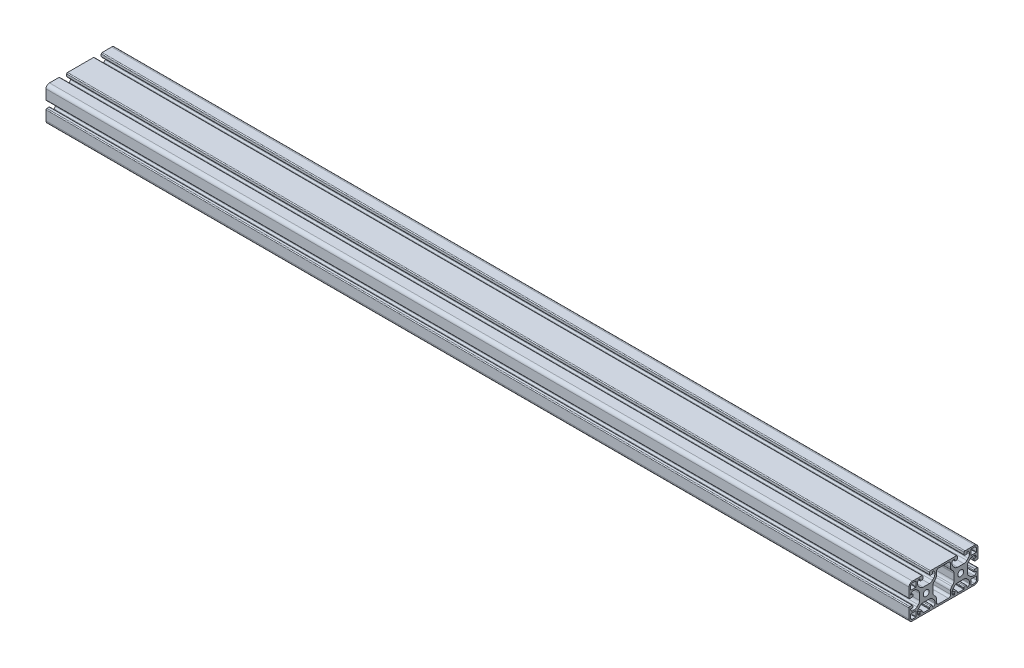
from build123d import *

# Parameters (mm, degrees)
MODEL_R                = 3.4
STRUKTURBAUTEIL1_DEPTH = 1000


with BuildPart() as part:
    # Model → Strukturbauteil1 (new body)
    with BuildSketch(Plane(origin=(0, 0, 0), x_dir=(0, 0, -1), z_dir=(1, 0, 0))):
        with BuildLine():
            Line((12.9068525, 9.2144665), (11.4644655, 10.6568555))
            ThreePointArc((11.4644655, 10.6568555), (10.380602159, 12.278971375), (9.9999995, 14.1923875))
            Line((9.9999995, 14.1923875), (9.9999995, 15.5000005))
            ThreePointArc((9.9999995, 15.5000005), (10.732232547, 17.267767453), (12.4999995, 18.0000005))
            Line((12.4999995, 18.0000005), (12.5499985, 18.0000005))
            ThreePointArc((12.5499985, 18.0000005), (12.868197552, 17.868198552), (12.9999995, 17.5499995))
            Line((12.9999995, 17.5499995), (12.9999995, 16.0000005))
            ThreePointArc((12.9999995, 16.0000005), (13.146446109, 15.646447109), (13.4999995, 15.5000005))
            Line((13.4999995, 15.5000005), (14.9999995, 15.5000005))
            ThreePointArc((14.9999995, 15.5000005), (15.707106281, 15.792893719), (15.9999995, 16.5000005))
            Line((15.9999995, 16.5000005), (15.9999995, 19.0000005))
            ThreePointArc((15.9999995, 19.0000005), (15.707106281, 19.707107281), (14.9999995, 20.0000005))
            Line((14.9999995, 20.0000005), (-15.0000005, 20.0000005))
            ThreePointArc((-15.0000005, 20.0000005), (-15.707107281, 19.707107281), (-16.0000005, 19.0000005))
            Line((-16.0000005, 19.0000005), (-16.0000005, 16.5000005))
            ThreePointArc((-16.0000005, 16.5000005), (-15.707107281, 15.792893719), (-15.0000005, 15.5000005))
            Line((-15.0000005, 15.5000005), (-13.5000005, 15.5000005))
            ThreePointArc((-13.5000005, 15.5000005), (-13.146447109, 15.646447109), (-13.0000005, 16.0000005))
            Line((-13.0000005, 16.0000005), (-13.0000005, 17.5499995))
            ThreePointArc((-13.0000005, 17.5499995), (-12.868198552, 17.868198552), (-12.5499995, 18.0000005))
            Line((-12.5499995, 18.0000005), (-12.5000005, 18.0000005))
            ThreePointArc((-12.5000005, 18.0000005), (-10.732233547, 17.267767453), (-10.0000005, 15.5000005))
            Line((-10.0000005, 15.5000005), (-10.0000005, 14.1923875))
            ThreePointArc((-10.0000005, 14.1923875), (-10.380603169, 12.278971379), (-11.4644665, 10.6568555))
            Line((-11.4644665, 10.6568555), (-12.9068555, 9.2144665))
            ThreePointArc((-12.9068555, 9.2144665), (-14.528972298, 8.130602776), (-16.4423895, 7.7500005))
            Line((-16.4423895, 7.7500005), (-23.5576115, 7.7500005))
            ThreePointArc((-23.5576115, 7.7500005), (-25.471028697, 8.130602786), (-27.0931455, 9.2144665))
            Line((-27.0931455, 9.2144665), (-28.5355345, 10.6568555))
            ThreePointArc((-28.5355345, 10.6568555), (-29.619397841, 12.278971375), (-30.0000005, 14.1923875))
            Line((-30.0000005, 14.1923875), (-30.0000005, 15.5000005))
            ThreePointArc((-30.0000005, 15.5000005), (-29.267767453, 17.267767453), (-27.5000005, 18.0000005))
            Line((-27.5000005, 18.0000005), (-27.4500005, 18.0000005))
            ThreePointArc((-27.4500005, 18.0000005), (-27.131802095, 17.868198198), (-27.0000005, 17.5499995))
            Line((-27.0000005, 17.5499995), (-27.0000005, 16.0000005))
            ThreePointArc((-27.0000005, 16.0000005), (-26.853553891, 15.646447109), (-26.5000005, 15.5000005))
            Line((-26.5000005, 15.5000005), (-25.0000005, 15.5000005))
            ThreePointArc((-25.0000005, 15.5000005), (-24.292893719, 15.792893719), (-24.0000005, 16.5000005))
            Line((-24.0000005, 16.5000005), (-24.0000005, 19.0000005))
            ThreePointArc((-24.0000005, 19.0000005), (-24.292893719, 19.707107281), (-25.0000005, 20.0000005))
            Line((-25.0000005, 20.0000005), (-36.0000005, 20.0000005))
            ThreePointArc((-36.0000005, 20.0000005), (-38.828427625, 18.828427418), (-40, 16))
            Line((-40, 16), (-40, 5))
            ThreePointArc((-40, 5), (-39.707106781, 4.292893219), (-39, 4))
            Line((-39, 4), (-36.5, 4))
            ThreePointArc((-36.5, 4), (-35.792893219, 4.292893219), (-35.5, 5))
            Line((-35.5, 5), (-35.5, 6.5))
            ThreePointArc((-35.5, 6.5), (-35.646446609, 6.853553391), (-36, 7))
            Line((-36, 7), (-37.55, 7))
            ThreePointArc((-37.55, 7), (-37.868198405, 7.131802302), (-38, 7.450001))
            Line((-38, 7.450001), (-38, 7.5))
            ThreePointArc((-38, 7.5), (-37.267766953, 9.267766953), (-35.5, 10))
            Line((-35.5, 10), (-34.192388, 10))
            ThreePointArc((-34.192388, 10), (-32.278971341, 9.619397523), (-30.656855, 8.535534))
            Line((-30.656855, 8.535534), (-29.214466, 7.093145))
            ThreePointArc((-29.214466, 7.093145), (-28.130602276, 5.471028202), (-27.75, 3.557611))
            Line((-27.75, 3.557611), (-27.75, -3.557611))
            ThreePointArc((-27.75, -3.557611), (-28.130602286, -5.471028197), (-29.214466, -7.093145))
            Line((-29.214466, -7.093145), (-30.656855, -8.535534))
            ThreePointArc((-30.656855, -8.535534), (-32.278971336, -9.619397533), (-34.192388, -10))
            Line((-34.192388, -10), (-35.5, -10))
            ThreePointArc((-35.5, -10), (-37.267766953, -9.267766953), (-38, -7.5))
            Line((-38, -7.5), (-38, -7.45))
            ThreePointArc((-38, -7.45), (-37.868198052, -7.131801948), (-37.55, -7))
            Line((-37.55, -7), (-36, -7))
            ThreePointArc((-36, -7), (-35.646446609, -6.853553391), (-35.5, -6.5))
            Line((-35.5, -6.5), (-35.5, -5))
            ThreePointArc((-35.5, -5), (-35.792893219, -4.292893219), (-36.5, -4))
            Line((-36.5, -4), (-39, -4))
            ThreePointArc((-39, -4), (-39.707106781, -4.292893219), (-40, -5))
            Line((-40, -5), (-40, -16))
            ThreePointArc((-40, -16), (-38.828427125, -18.828427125), (-36, -20))
            Line((-36, -20), (36, -20))
            ThreePointArc((36, -20), (38.828426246, -18.828425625), (39.9999985, -15.9999985))
            Line((39.9999985, -15.9999985), (39.9999985, -4.9999985))
            ThreePointArc((39.9999985, -4.9999985), (39.707105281, -4.292891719), (38.9999985, -3.9999985))
            Line((38.9999985, -3.9999985), (36.4999985, -3.9999985))
            ThreePointArc((36.4999985, -3.9999985), (35.792891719, -4.292891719), (35.4999985, -4.9999985))
            Line((35.4999985, -4.9999985), (35.4999985, -6.4999985))
            ThreePointArc((35.4999985, -6.4999985), (35.646445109, -6.853551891), (35.9999985, -6.9999985))
            Line((35.9999985, -6.9999985), (37.5500015, -6.9999985))
            ThreePointArc((37.5500015, -6.9999985), (37.868197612, -7.131801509), (37.9999985, -7.4499985))
            Line((37.9999985, -7.4499985), (37.9999985, -7.4999985))
            ThreePointArc((37.9999985, -7.4999985), (37.267765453, -9.267765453), (35.4999985, -9.9999985))
            Line((35.4999985, -9.9999985), (34.1923885, -9.9999985))
            ThreePointArc((34.1923885, -9.9999985), (32.278969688, -9.619396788), (30.6568515, -8.5355325))
            Line((30.6568515, -8.5355325), (29.2144605, -7.0931435))
            ThreePointArc((29.2144605, -7.0931435), (28.130598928, -5.471026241), (27.7499985, -3.5576095))
            Line((27.7499985, -3.5576095), (27.7499985, 3.5576125))
            ThreePointArc((27.7499985, 3.5576125), (28.130602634, 5.471030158), (29.2144685, 7.0931465))
            Line((29.2144685, 7.0931465), (30.6568515, 8.5355355))
            ThreePointArc((30.6568515, 8.5355355), (32.278969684, 9.619399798), (34.1923885, 10.0000015))
            Line((34.1923885, 10.0000015), (35.4999985, 10.0000015))
            ThreePointArc((35.4999985, 10.0000015), (37.267765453, 9.267768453), (37.9999985, 7.5000015))
            Line((37.9999985, 7.5000015), (37.9999985, 7.4500025))
            ThreePointArc((37.9999985, 7.4500025), (37.868197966, 7.131804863), (37.5500015, 7.0000015))
            Line((37.5500015, 7.0000015), (35.9999985, 7.0000015))
            ThreePointArc((35.9999985, 7.0000015), (35.646445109, 6.853554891), (35.4999985, 6.5000015))
            Line((35.4999985, 6.5000015), (35.4999985, 5.0000015))
            ThreePointArc((35.4999985, 5.0000015), (35.792891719, 4.292894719), (36.4999985, 4.0000015))
            Line((36.4999985, 4.0000015), (38.9999985, 4.0000015))
            ThreePointArc((38.9999985, 4.0000015), (39.707103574, 4.292894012), (39.9999975, 4.9999985))
            Line((39.9999975, 4.9999985), (39.9999975, 15.9999985))
            ThreePointArc((39.9999975, 15.9999985), (38.828425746, 18.828425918), (35.9999995, 20.0000005))
            Line((35.9999995, 20.0000005), (24.9999995, 20.0000005))
            ThreePointArc((24.9999995, 20.0000005), (24.292892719, 19.707107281), (23.9999995, 19.0000005))
            Line((23.9999995, 19.0000005), (23.9999995, 16.5000005))
            ThreePointArc((23.9999995, 16.5000005), (24.292892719, 15.792893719), (24.9999995, 15.5000005))
            Line((24.9999995, 15.5000005), (26.4999995, 15.5000005))
            ThreePointArc((26.4999995, 15.5000005), (26.853552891, 15.646447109), (26.9999995, 16.0000005))
            Line((26.9999995, 16.0000005), (26.9999995, 17.5499995))
            ThreePointArc((26.9999995, 17.5499995), (27.131800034, 17.868197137), (27.4499965, 18.0000005))
            Line((27.4499965, 18.0000005), (27.4999995, 18.0000005))
            ThreePointArc((27.4999995, 18.0000005), (29.267766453, 17.267767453), (29.9999995, 15.5000005))
            Line((29.9999995, 15.5000005), (29.9999995, 14.1923875))
            ThreePointArc((29.9999995, 14.1923875), (29.619398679, 12.27897184), (28.5355375, 10.6568555))
            Line((28.5355375, 10.6568555), (27.0931465, 9.2144665))
            ThreePointArc((27.0931465, 9.2144665), (25.471029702, 8.130602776), (23.5576125, 7.7500005))
            Line((23.5576125, 7.7500005), (16.4423865, 7.7500005))
            ThreePointArc((16.4423865, 7.7500005), (14.528969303, 8.130602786), (12.9068525, 9.2144665))
        make_face()
        with Locations((-20, 0)):
            Circle(MODEL_R, mode=Mode.SUBTRACT)
        with Locations((20, 0)):
            Circle(MODEL_R, mode=Mode.SUBTRACT)
        with BuildLine():
            Line((10.785534, 7.093145), (9.664467, 8.214214))
            ThreePointArc((9.664467, 8.214214), (8.580603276, 9.836330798), (8.200001, 11.749748))
            Line((8.200001, 11.749748), (8.200001, 15.5))
            ThreePointArc((8.200001, 15.5), (7.467767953, 17.267766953), (5.700001, 18))
            Line((5.700001, 18), (-5.700001, 18))
            ThreePointArc((-5.700001, 18), (-7.467767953, 17.267766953), (-8.200001, 15.5))
            Line((-8.200001, 15.5), (-8.200001, 11.749748))
            ThreePointArc((-8.200001, 11.749748), (-8.580603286, 9.836330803), (-9.664467, 8.214214))
            Line((-9.664467, 8.214214), (-10.785534, 7.093145))
            ThreePointArc((-10.785534, 7.093145), (-11.869397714, 5.471028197), (-12.25, 3.557611))
            Line((-12.25, 3.557611), (-12.25, -3.557611))
            ThreePointArc((-12.25, -3.557611), (-11.869397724, -5.471028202), (-10.785534, -7.093145))
            Line((-10.785534, -7.093145), (-9.664467, -8.214213))
            ThreePointArc((-9.664467, -8.214213), (-8.580603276, -9.836329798), (-8.200001, -11.749747))
            Line((-8.200001, -11.749747), (-8.200001, -15.5))
            ThreePointArc((-8.200001, -15.5), (-7.467767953, -17.267766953), (-5.700001, -18))
            Line((-5.700001, -18), (5.700001, -18))
            ThreePointArc((5.700001, -18), (7.467767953, -17.267766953), (8.200001, -15.5))
            Line((8.200001, -15.5), (8.200001, -11.749747))
            ThreePointArc((8.200001, -11.749747), (8.580603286, -9.836329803), (9.664467, -8.214213))
            Line((9.664467, -8.214213), (10.785534, -7.093145))
            ThreePointArc((10.785534, -7.093145), (11.869397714, -5.471028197), (12.25, -3.557611))
            Line((12.25, -3.557611), (12.25, 3.557611))
            ThreePointArc((12.25, 3.557611), (11.869397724, 5.471028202), (10.785534, 7.093145))
        make_face(mode=Mode.SUBTRACT)
        with BuildLine():
            Line((-11.464466, -10.656855), (-12.906855, -9.214466))
            ThreePointArc((-12.906855, -9.214466), (-14.528971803, -8.130602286), (-16.442389, -7.75))
            Line((-16.442389, -7.75), (-23.557611, -7.75))
            ThreePointArc((-23.557611, -7.75), (-25.471028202, -8.130602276), (-27.093145, -9.214466))
            Line((-27.093145, -9.214466), (-28.535534, -10.656855))
            ThreePointArc((-28.535534, -10.656855), (-29.619397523, -12.278971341), (-30, -14.192388))
            Line((-30, -14.192388), (-30, -15.5))
            ThreePointArc((-30, -15.5), (-29.267766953, -17.267766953), (-27.5, -18))
            ThreePointArc((-27.5, -18), (-27.146446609, -17.853553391), (-27, -17.5))
            Line((-27, -17.5), (-27, -16))
            ThreePointArc((-27, -16), (-26.853553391, -15.646446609), (-26.5, -15.5))
            Line((-26.5, -15.5), (-25, -15.5))
            ThreePointArc((-25, -15.5), (-24.292893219, -15.792893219), (-24, -16.5))
            Line((-24, -16.5), (-24, -17.5))
            ThreePointArc((-24, -17.5), (-23.853553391, -17.853553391), (-23.5, -18))
            Line((-23.5, -18), (-16.5, -18))
            ThreePointArc((-16.5, -18), (-16.146446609, -17.853553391), (-16, -17.5))
            Line((-16, -17.5), (-16, -16.5))
            ThreePointArc((-16, -16.5), (-15.707106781, -15.792893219), (-15, -15.5))
            Line((-15, -15.5), (-13.5, -15.5))
            ThreePointArc((-13.5, -15.5), (-13.146446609, -15.646446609), (-13, -16))
            Line((-13, -16), (-13, -17.5))
            ThreePointArc((-13, -17.5), (-12.853553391, -17.853553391), (-12.5, -18))
            ThreePointArc((-12.5, -18), (-10.732233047, -17.267766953), (-10, -15.5))
            Line((-10, -15.5), (-10, -14.192388))
            ThreePointArc((-10, -14.192388), (-10.380602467, -12.278971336), (-11.464466, -10.656855))
        make_face(mode=Mode.SUBTRACT)
        with BuildLine():
            Line((28.535538, -10.656855), (27.093147, -9.214466))
            ThreePointArc((27.093147, -9.214466), (25.471030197, -8.130602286), (23.557613, -7.75))
            Line((23.557613, -7.75), (16.442387, -7.75))
            ThreePointArc((16.442387, -7.75), (14.528969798, -8.130602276), (12.906853, -9.214466))
            Line((12.906853, -9.214466), (11.464466, -10.656855))
            ThreePointArc((11.464466, -10.656855), (10.380602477, -12.278971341), (10, -14.192388))
            Line((10, -14.192388), (10, -15.5))
            ThreePointArc((10, -15.5), (10.732233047, -17.267766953), (12.5, -18))
            ThreePointArc((12.5, -18), (12.853553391, -17.853553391), (13, -17.5))
            Line((13, -17.5), (13, -16))
            ThreePointArc((13, -16), (13.146446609, -15.646446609), (13.5, -15.5))
            Line((13.5, -15.5), (15, -15.5))
            ThreePointArc((15, -15.5), (15.707106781, -15.792893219), (16, -16.5))
            Line((16, -16.5), (16, -17.5))
            ThreePointArc((16, -17.5), (16.146446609, -17.853553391), (16.5, -18))
            Line((16.5, -18), (23.5, -18))
            ThreePointArc((23.5, -18), (23.853553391, -17.853553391), (24, -17.5))
            Line((24, -17.5), (24, -16.5))
            ThreePointArc((24, -16.5), (24.292893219, -15.792893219), (25, -15.5))
            Line((25, -15.5), (26.5, -15.5))
            ThreePointArc((26.5, -15.5), (26.853553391, -15.646446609), (27, -16))
            Line((27, -16), (27, -17.5))
            ThreePointArc((27, -17.5), (27.146446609, -17.853553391), (27.5, -18))
            ThreePointArc((27.5, -18), (29.267766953, -17.267766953), (30, -15.5))
            Line((30, -15.5), (30, -14.192388))
            ThreePointArc((30, -14.192388), (29.61939938, -12.278971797), (28.535538, -10.656855))
        make_face(mode=Mode.SUBTRACT)
        with BuildLine():
            Line((32.300003, -18.1999985), (36, -18.1999985))
            ThreePointArc((36, -18.1999985), (37.555632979, -17.555632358), (38.199997, -15.9999985))
            Line((38.199997, -15.9999985), (38.199997, -12.2999985))
            ThreePointArc((38.199997, -12.2999985), (38.053550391, -11.946445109), (37.699997, -11.7999985))
            Line((37.699997, -11.7999985), (32.300003, -11.7999985))
            ThreePointArc((32.300003, -11.7999985), (31.946449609, -11.946445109), (31.800003, -12.2999985))
            Line((31.800003, -12.2999985), (31.800003, -17.6999985))
            ThreePointArc((31.800003, -17.6999985), (31.946449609, -18.053551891), (32.300003, -18.1999985))
        make_face(mode=Mode.SUBTRACT)
        with BuildLine():
            Line((-36, -18.2), (-32.3, -18.2))
            ThreePointArc((-32.3, -18.2), (-31.946446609, -18.053553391), (-31.8, -17.7))
            Line((-31.8, -17.7), (-31.8, -12.3))
            ThreePointArc((-31.8, -12.3), (-31.946446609, -11.946446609), (-32.3, -11.8))
            Line((-32.3, -11.8), (-37.7, -11.8))
            ThreePointArc((-37.7, -11.8), (-38.053553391, -11.946446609), (-38.2, -12.3))
            Line((-38.2, -12.3), (-38.2, -16))
            ThreePointArc((-38.2, -16), (-37.555634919, -17.555634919), (-36, -18.2))
        make_face(mode=Mode.SUBTRACT)
        with BuildLine():
            Line((-37.7000005, 11.799999), (-32.3000005, 11.799999))
            ThreePointArc((-32.3000005, 11.799999), (-31.946447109, 11.946445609), (-31.8000005, 12.299999))
            Line((-31.8000005, 12.299999), (-31.8000005, 17.700001))
            ThreePointArc((-31.8000005, 17.700001), (-31.946447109, 18.053554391), (-32.3000005, 18.200001))
            Line((-32.3000005, 18.200001), (-36.0000005, 18.200001))
            ThreePointArc((-36.0000005, 18.200001), (-37.555635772, 17.555635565), (-38.2000005, 16))
            Line((-38.2000005, 16), (-38.2000005, 12.299999))
            ThreePointArc((-38.2000005, 12.299999), (-38.053553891, 11.946445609), (-37.7000005, 11.799999))
        make_face(mode=Mode.SUBTRACT)
        with BuildLine():
            Line((32.3000025, 11.7999975), (37.6999965, 11.7999975))
            ThreePointArc((37.6999965, 11.7999975), (38.053549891, 11.946444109), (38.1999965, 12.2999975))
            Line((38.1999965, 12.2999975), (38.1999965, 15.9999985))
            ThreePointArc((38.1999965, 15.9999985), (37.555632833, 17.555633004), (35.9999995, 18.1999995))
            Line((35.9999995, 18.1999995), (32.3000025, 18.1999995))
            ThreePointArc((32.3000025, 18.1999995), (31.946449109, 18.053552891), (31.8000025, 17.6999995))
            Line((31.8000025, 17.6999995), (31.8000025, 12.2999975))
            ThreePointArc((31.8000025, 12.2999975), (31.946449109, 11.946444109), (32.3000025, 11.7999975))
        make_face(mode=Mode.SUBTRACT)
    extrude(amount=STRUKTURBAUTEIL1_DEPTH)


solid = part.part
